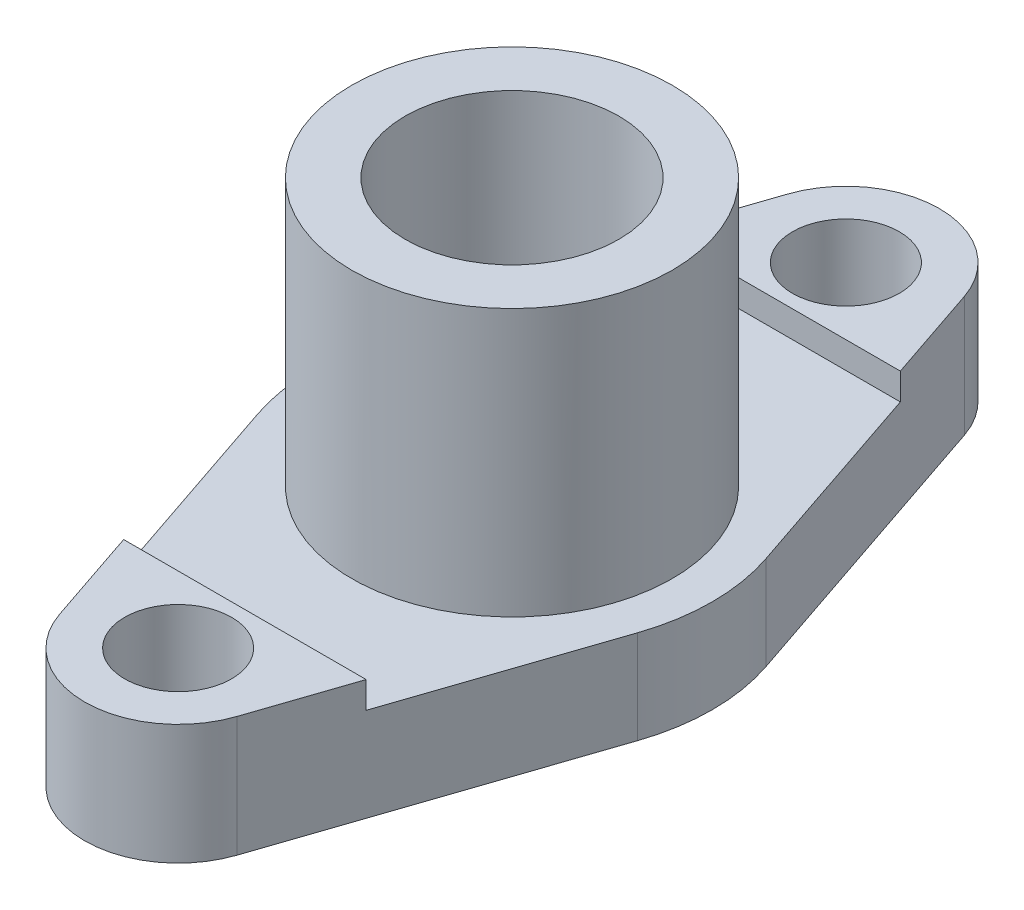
ISO-10303-21;
HEADER;
FILE_DESCRIPTION(('STEP AP214'),'2;1');
FILE_NAME('part.step','',(''),(''),'','','');
FILE_SCHEMA(('AUTOMOTIVE_DESIGN { 1 0 10303 214 1 1 1 1 }'));
ENDSEC;
DATA;
#1=APPLICATION_CONTEXT('core data for automotive mechanical design processes');
#2=APPLICATION_PROTOCOL_DEFINITION('international standard','automotive_design',2000,#1);
#3=PRODUCT_CONTEXT('',#1,'mechanical');
#4=PRODUCT('Part','Part','',(#3));
#5=PRODUCT_RELATED_PRODUCT_CATEGORY('part','',(#4));
#6=PRODUCT_DEFINITION_FORMATION('','',#4);
#7=PRODUCT_DEFINITION_CONTEXT('part definition',#1,'design');
#8=PRODUCT_DEFINITION('design','',#6,#7);
#9=PRODUCT_DEFINITION_SHAPE('','',#8);
#10=(LENGTH_UNIT() NAMED_UNIT(*) SI_UNIT(.MILLI.,.METRE.));
#11=(NAMED_UNIT(*) PLANE_ANGLE_UNIT() SI_UNIT($,.RADIAN.));
#12=(NAMED_UNIT(*) SI_UNIT($,.STERADIAN.) SOLID_ANGLE_UNIT());
#13=UNCERTAINTY_MEASURE_WITH_UNIT(LENGTH_MEASURE(1.E-05),#10,'distance_accuracy_value','');
#14=(GEOMETRIC_REPRESENTATION_CONTEXT(3) GLOBAL_UNCERTAINTY_ASSIGNED_CONTEXT((#13)) GLOBAL_UNIT_ASSIGNED_CONTEXT((#10,
#11,#12)) REPRESENTATION_CONTEXT('',''));
#15=CARTESIAN_POINT('',(0.,0.,0.));
#16=DIRECTION('',(0.,0.,1.));
#17=DIRECTION('',(1.,0.,0.));
#18=AXIS2_PLACEMENT_3D('',#15,#16,#17);
#19=CARTESIAN_POINT('',(0.,7.,0.));
#20=DIRECTION('',(0.,-1.,0.));
#21=DIRECTION('',(0.,0.,-1.));
#22=AXIS2_PLACEMENT_3D('',#19,#20,#21);
#23=PLANE('',#22);
#24=CARTESIAN_POINT('',(0.,7.,0.));
#25=DIRECTION('',(0.,-1.,0.));
#26=DIRECTION('',(0.,0.,-1.));
#27=AXIS2_PLACEMENT_3D('',#24,#25,#26);
#28=CIRCLE('',#27,12.);
#29=CARTESIAN_POINT('',(0.,7.,-12.));
#30=VERTEX_POINT('',#29);
#31=EDGE_CURVE('E11',#30,#30,#28,.T.);
#32=ORIENTED_EDGE('',*,*,#31,.T.);
#33=EDGE_LOOP('',(#32));
#34=FACE_BOUND('',#33,.T.);
#35=DIRECTION('',(-1.,0.,0.));
#36=VECTOR('',#35,1.);
#37=CARTESIAN_POINT('',(9.07731152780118,7.,20.));
#38=LINE('',#37,#36);
#39=CARTESIAN_POINT('',(9.07731152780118,7.,20.));
#40=VERTEX_POINT('',#39);
#41=CARTESIAN_POINT('',(-9.07731152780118,7.,20.));
#42=VERTEX_POINT('',#41);
#43=EDGE_CURVE('E150',#40,#42,#38,.T.);
#44=ORIENTED_EDGE('',*,*,#43,.F.);
#45=DIRECTION('',(-0.320000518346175,0.,0.947417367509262));
#46=VECTOR('',#45,1.);
#47=CARTESIAN_POINT('',(14.2112727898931,7.,4.80001192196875));
#48=LINE('',#47,#46);
#49=CARTESIAN_POINT('',(14.2112727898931,7.,4.80001192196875));
#50=VERTEX_POINT('',#49);
#51=EDGE_CURVE('E211',#50,#40,#48,.T.);
#52=ORIENTED_EDGE('',*,*,#51,.F.);
#53=CARTESIAN_POINT('',(0.,7.,0.));
#54=DIRECTION('',(0.,-1.,0.));
#55=DIRECTION('',(0.,0.,-1.));
#56=AXIS2_PLACEMENT_3D('',#53,#54,#55);
#57=CIRCLE('',#56,15.0000129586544);
#58=CARTESIAN_POINT('',(14.2112727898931,7.,-4.80001192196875));
#59=VERTEX_POINT('',#58);
#60=EDGE_CURVE('E208',#59,#50,#57,.T.);
#61=ORIENTED_EDGE('',*,*,#60,.F.);
#62=DIRECTION('',(0.320000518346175,0.,0.947417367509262));
#63=VECTOR('',#62,1.);
#64=CARTESIAN_POINT('',(14.2112727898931,7.,-4.80001192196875));
#65=LINE('',#64,#63);
#66=CARTESIAN_POINT('',(9.07731152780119,7.,-20.));
#67=VERTEX_POINT('',#66);
#68=EDGE_CURVE('E47',#67,#59,#65,.T.);
#69=ORIENTED_EDGE('',*,*,#68,.F.);
#70=DIRECTION('',(1.,0.,0.));
#71=VECTOR('',#70,1.);
#72=CARTESIAN_POINT('',(9.07731152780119,7.,-20.));
#73=LINE('',#72,#71);
#74=CARTESIAN_POINT('',(-9.07731152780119,7.,-20.));
#75=VERTEX_POINT('',#74);
#76=EDGE_CURVE('E165',#75,#67,#73,.T.);
#77=ORIENTED_EDGE('',*,*,#76,.F.);
#78=DIRECTION('',(0.320000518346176,0.,-0.947417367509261));
#79=VECTOR('',#78,1.);
#80=CARTESIAN_POINT('',(-14.2112727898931,7.,-4.80001192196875));
#81=LINE('',#80,#79);
#82=CARTESIAN_POINT('',(-14.2112727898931,7.,-4.80001192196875));
#83=VERTEX_POINT('',#82);
#84=EDGE_CURVE('E218',#83,#75,#81,.T.);
#85=ORIENTED_EDGE('',*,*,#84,.F.);
#86=CARTESIAN_POINT('',(0.,7.,0.));
#87=DIRECTION('',(0.,-1.,0.));
#88=DIRECTION('',(0.,0.,-1.));
#89=AXIS2_PLACEMENT_3D('',#86,#87,#88);
#90=CIRCLE('',#89,15.0000129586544);
#91=CARTESIAN_POINT('',(-14.2112727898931,7.,4.80001192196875));
#92=VERTEX_POINT('',#91);
#93=EDGE_CURVE('E215',#92,#83,#90,.T.);
#94=ORIENTED_EDGE('',*,*,#93,.F.);
#95=DIRECTION('',(-0.320000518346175,0.,-0.947417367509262));
#96=VECTOR('',#95,1.);
#97=CARTESIAN_POINT('',(-6.63192157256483,7.,27.2400036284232));
#98=LINE('',#97,#96);
#99=EDGE_CURVE('E213',#42,#92,#98,.T.);
#100=ORIENTED_EDGE('',*,*,#99,.F.);
#101=EDGE_LOOP('',(#44,#52,#61,#69,#77,#85,#94,#100));
#102=FACE_BOUND('',#101,.T.);
#103=ADVANCED_FACE('F31',(#34,#102),#23,.F.);
#104=CARTESIAN_POINT('',(0.,27.,0.));
#105=DIRECTION('',(0.,-1.,0.));
#106=DIRECTION('',(0.,0.,-1.));
#107=AXIS2_PLACEMENT_3D('',#104,#105,#106);
#108=CYLINDRICAL_SURFACE('',#107,12.);
#109=CARTESIAN_POINT('',(0.,27.,0.));
#110=DIRECTION('',(0.,1.,0.));
#111=DIRECTION('',(0.,0.,1.));
#112=AXIS2_PLACEMENT_3D('',#109,#110,#111);
#113=CIRCLE('',#112,12.);
#114=CARTESIAN_POINT('',(0.,27.,12.));
#115=VERTEX_POINT('',#114);
#116=EDGE_CURVE('E35',#115,#115,#113,.T.);
#117=ORIENTED_EDGE('',*,*,#116,.F.);
#118=EDGE_LOOP('',(#117));
#119=FACE_BOUND('',#118,.T.);
#120=ORIENTED_EDGE('',*,*,#31,.F.);
#121=EDGE_LOOP('',(#120));
#122=FACE_BOUND('',#121,.T.);
#123=ADVANCED_FACE('F33',(#119,#122),#108,.T.);
#124=CARTESIAN_POINT('',(0.,27.,0.));
#125=DIRECTION('',(0.,1.,0.));
#126=DIRECTION('',(0.,0.,1.));
#127=AXIS2_PLACEMENT_3D('',#124,#125,#126);
#128=PLANE('',#127);
#129=ORIENTED_EDGE('',*,*,#116,.T.);
#130=EDGE_LOOP('',(#129));
#131=FACE_BOUND('',#130,.T.);
#132=CARTESIAN_POINT('',(0.,27.,0.));
#133=DIRECTION('',(0.,1.,0.));
#134=DIRECTION('',(0.,0.,1.));
#135=AXIS2_PLACEMENT_3D('',#132,#133,#134);
#136=CIRCLE('',#135,8.);
#137=CARTESIAN_POINT('',(0.,27.,8.));
#138=VERTEX_POINT('',#137);
#139=EDGE_CURVE('E234',#138,#138,#136,.T.);
#140=ORIENTED_EDGE('',*,*,#139,.F.);
#141=EDGE_LOOP('',(#140));
#142=FACE_BOUND('',#141,.T.);
#143=ADVANCED_FACE('F241',(#131,#142),#128,.T.);
#144=CARTESIAN_POINT('',(0.,0.,0.));
#145=DIRECTION('',(0.,1.,0.));
#146=DIRECTION('',(0.,0.,1.));
#147=AXIS2_PLACEMENT_3D('',#144,#145,#146);
#148=PLANE('',#147);
#149=CARTESIAN_POINT('',(0.,0.,0.));
#150=DIRECTION('',(0.,1.,0.));
#151=DIRECTION('',(0.,0.,1.));
#152=AXIS2_PLACEMENT_3D('',#149,#150,#151);
#153=CIRCLE('',#152,8.);
#154=CARTESIAN_POINT('',(0.,0.,8.));
#155=VERTEX_POINT('',#154);
#156=EDGE_CURVE('E223',#155,#155,#153,.T.);
#157=ORIENTED_EDGE('',*,*,#156,.T.);
#158=EDGE_LOOP('',(#157));
#159=FACE_BOUND('',#158,.T.);
#160=CARTESIAN_POINT('',(0.,0.,0.));
#161=DIRECTION('',(0.,-1.,0.));
#162=DIRECTION('',(0.,0.,-1.));
#163=AXIS2_PLACEMENT_3D('',#160,#161,#162);
#164=CIRCLE('',#163,15.0000129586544);
#165=CARTESIAN_POINT('',(14.2112727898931,0.,-4.80001192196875));
#166=VERTEX_POINT('',#165);
#167=CARTESIAN_POINT('',(14.2112727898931,0.,4.80001192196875));
#168=VERTEX_POINT('',#167);
#169=EDGE_CURVE('E187',#166,#168,#164,.T.);
#170=ORIENTED_EDGE('',*,*,#169,.T.);
#171=DIRECTION('',(-0.320000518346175,0.,0.947417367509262));
#172=VECTOR('',#171,1.);
#173=CARTESIAN_POINT('',(14.2112727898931,0.,4.80001192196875));
#174=LINE('',#173,#172);
#175=CARTESIAN_POINT('',(6.63192157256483,0.,27.2400036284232));
#176=VERTEX_POINT('',#175);
#177=EDGE_CURVE('E190',#168,#176,#174,.T.);
#178=ORIENTED_EDGE('',*,*,#177,.T.);
#179=CARTESIAN_POINT('',(0.,0.,25.));
#180=DIRECTION('',(0.,-1.,0.));
#181=DIRECTION('',(0.,0.,-1.));
#182=AXIS2_PLACEMENT_3D('',#179,#180,#181);
#183=CIRCLE('',#182,7.);
#184=CARTESIAN_POINT('',(-6.63192157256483,0.,27.2400036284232));
#185=VERTEX_POINT('',#184);
#186=EDGE_CURVE('E129',#176,#185,#183,.T.);
#187=ORIENTED_EDGE('',*,*,#186,.T.);
#188=DIRECTION('',(-0.320000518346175,0.,-0.947417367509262));
#189=VECTOR('',#188,1.);
#190=CARTESIAN_POINT('',(-6.63192157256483,0.,27.2400036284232));
#191=LINE('',#190,#189);
#192=CARTESIAN_POINT('',(-14.2112727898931,0.,4.80001192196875));
#193=VERTEX_POINT('',#192);
#194=EDGE_CURVE('E193',#185,#193,#191,.T.);
#195=ORIENTED_EDGE('',*,*,#194,.T.);
#196=CARTESIAN_POINT('',(0.,0.,0.));
#197=DIRECTION('',(0.,-1.,0.));
#198=DIRECTION('',(0.,0.,-1.));
#199=AXIS2_PLACEMENT_3D('',#196,#197,#198);
#200=CIRCLE('',#199,15.0000129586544);
#201=CARTESIAN_POINT('',(-14.2112727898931,0.,-4.80001192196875));
#202=VERTEX_POINT('',#201);
#203=EDGE_CURVE('E196',#193,#202,#200,.T.);
#204=ORIENTED_EDGE('',*,*,#203,.T.);
#205=DIRECTION('',(0.320000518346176,0.,-0.947417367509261));
#206=VECTOR('',#205,1.);
#207=CARTESIAN_POINT('',(-14.2112727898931,0.,-4.80001192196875));
#208=LINE('',#207,#206);
#209=CARTESIAN_POINT('',(-6.63192157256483,0.,-27.2400036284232));
#210=VERTEX_POINT('',#209);
#211=EDGE_CURVE('E199',#202,#210,#208,.T.);
#212=ORIENTED_EDGE('',*,*,#211,.T.);
#213=CARTESIAN_POINT('',(0.,0.,-25.));
#214=DIRECTION('',(0.,-1.,0.));
#215=DIRECTION('',(0.,0.,-1.));
#216=AXIS2_PLACEMENT_3D('',#213,#214,#215);
#217=CIRCLE('',#216,7.);
#218=CARTESIAN_POINT('',(6.63192157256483,0.,-27.2400036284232));
#219=VERTEX_POINT('',#218);
#220=EDGE_CURVE('E202',#210,#219,#217,.T.);
#221=ORIENTED_EDGE('',*,*,#220,.T.);
#222=DIRECTION('',(0.320000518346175,0.,0.947417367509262));
#223=VECTOR('',#222,1.);
#224=CARTESIAN_POINT('',(14.2112727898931,0.,-4.80001192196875));
#225=LINE('',#224,#223);
#226=EDGE_CURVE('E205',#219,#166,#225,.T.);
#227=ORIENTED_EDGE('',*,*,#226,.T.);
#228=EDGE_LOOP('',(#170,#178,#187,#195,#204,#212,#221,#227));
#229=FACE_BOUND('',#228,.T.);
#230=CARTESIAN_POINT('',(0.,0.,-25.));
#231=DIRECTION('',(0.,-1.,0.));
#232=DIRECTION('',(0.,0.,-1.));
#233=AXIS2_PLACEMENT_3D('',#230,#231,#232);
#234=CIRCLE('',#233,4.);
#235=CARTESIAN_POINT('',(0.,0.,-29.));
#236=VERTEX_POINT('',#235);
#237=EDGE_CURVE('E184',#236,#236,#234,.T.);
#238=ORIENTED_EDGE('',*,*,#237,.F.);
#239=EDGE_LOOP('',(#238));
#240=FACE_BOUND('',#239,.T.);
#241=CARTESIAN_POINT('',(0.,0.,25.));
#242=DIRECTION('',(0.,-1.,0.));
#243=DIRECTION('',(0.,0.,-1.));
#244=AXIS2_PLACEMENT_3D('',#241,#242,#243);
#245=CIRCLE('',#244,4.);
#246=CARTESIAN_POINT('',(0.,0.,21.));
#247=VERTEX_POINT('',#246);
#248=EDGE_CURVE('E181',#247,#247,#245,.T.);
#249=ORIENTED_EDGE('',*,*,#248,.F.);
#250=EDGE_LOOP('',(#249));
#251=FACE_BOUND('',#250,.T.);
#252=ADVANCED_FACE('F279',(#159,#229,#240,#251),#148,.F.);
#253=CARTESIAN_POINT('',(0.,27.,0.));
#254=DIRECTION('',(0.,-1.,0.));
#255=DIRECTION('',(0.,0.,-1.));
#256=AXIS2_PLACEMENT_3D('',#253,#254,#255);
#257=CYLINDRICAL_SURFACE('',#256,8.);
#258=ORIENTED_EDGE('',*,*,#156,.F.);
#259=EDGE_LOOP('',(#258));
#260=FACE_BOUND('',#259,.T.);
#261=ORIENTED_EDGE('',*,*,#139,.T.);
#262=EDGE_LOOP('',(#261));
#263=FACE_BOUND('',#262,.T.);
#264=ADVANCED_FACE('F324',(#260,#263),#257,.F.);
#265=CARTESIAN_POINT('',(0.,7.,0.));
#266=DIRECTION('',(0.,-1.,0.));
#267=DIRECTION('',(0.,0.,-1.));
#268=AXIS2_PLACEMENT_3D('',#265,#266,#267);
#269=CYLINDRICAL_SURFACE('',#268,15.0000129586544);
#270=ORIENTED_EDGE('',*,*,#169,.F.);
#271=DIRECTION('',(0.,-1.,0.));
#272=VECTOR('',#271,1.);
#273=CARTESIAN_POINT('',(14.2112727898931,7.,-4.80001192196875));
#274=LINE('',#273,#272);
#275=EDGE_CURVE('E221',#59,#166,#274,.T.);
#276=ORIENTED_EDGE('',*,*,#275,.F.);
#277=ORIENTED_EDGE('',*,*,#60,.T.);
#278=DIRECTION('',(0.,-1.,0.));
#279=VECTOR('',#278,1.);
#280=CARTESIAN_POINT('',(14.2112727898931,7.,4.80001192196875));
#281=LINE('',#280,#279);
#282=EDGE_CURVE('E134',#50,#168,#281,.T.);
#283=ORIENTED_EDGE('',*,*,#282,.T.);
#284=EDGE_LOOP('',(#270,#276,#277,#283));
#285=FACE_BOUND('',#284,.T.);
#286=ADVANCED_FACE('F260',(#285),#269,.T.);
#287=CARTESIAN_POINT('',(14.2112727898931,7.,-4.80001192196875));
#288=DIRECTION('',(0.947417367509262,0.,-0.320000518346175));
#289=DIRECTION('',(-0.320000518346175,0.,-0.947417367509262));
#290=AXIS2_PLACEMENT_3D('',#287,#288,#289);
#291=PLANE('',#290);
#292=ORIENTED_EDGE('',*,*,#226,.F.);
#293=DIRECTION('',(0.,-1.,0.));
#294=VECTOR('',#293,1.);
#295=CARTESIAN_POINT('',(6.63192157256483,7.,-27.2400036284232));
#296=LINE('',#295,#294);
#297=CARTESIAN_POINT('',(6.63192157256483,9.,-27.2400036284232));
#298=VERTEX_POINT('',#297);
#299=EDGE_CURVE('E224',#298,#219,#296,.T.);
#300=ORIENTED_EDGE('',*,*,#299,.F.);
#301=DIRECTION('',(-0.320000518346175,0.,-0.947417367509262));
#302=VECTOR('',#301,1.);
#303=CARTESIAN_POINT('',(9.07731152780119,9.,-20.));
#304=LINE('',#303,#302);
#305=CARTESIAN_POINT('',(9.07731152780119,9.,-20.));
#306=VERTEX_POINT('',#305);
#307=EDGE_CURVE('E166',#306,#298,#304,.T.);
#308=ORIENTED_EDGE('',*,*,#307,.F.);
#309=DIRECTION('',(0.,-1.,0.));
#310=VECTOR('',#309,1.);
#311=CARTESIAN_POINT('',(9.07731152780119,9.,-20.));
#312=LINE('',#311,#310);
#313=EDGE_CURVE('E176',#306,#67,#312,.T.);
#314=ORIENTED_EDGE('',*,*,#313,.T.);
#315=ORIENTED_EDGE('',*,*,#68,.T.);
#316=ORIENTED_EDGE('',*,*,#275,.T.);
#317=EDGE_LOOP('',(#292,#300,#308,#314,#315,#316));
#318=FACE_BOUND('',#317,.T.);
#319=ADVANCED_FACE('F307',(#318),#291,.T.);
#320=CARTESIAN_POINT('',(0.,7.,-25.));
#321=DIRECTION('',(0.,-1.,0.));
#322=DIRECTION('',(0.,0.,-1.));
#323=AXIS2_PLACEMENT_3D('',#320,#321,#322);
#324=CYLINDRICAL_SURFACE('',#323,7.);
#325=ORIENTED_EDGE('',*,*,#220,.F.);
#326=DIRECTION('',(0.,-1.,0.));
#327=VECTOR('',#326,1.);
#328=CARTESIAN_POINT('',(-6.63192157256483,7.,-27.2400036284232));
#329=LINE('',#328,#327);
#330=CARTESIAN_POINT('',(-6.63192157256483,9.,-27.2400036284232));
#331=VERTEX_POINT('',#330);
#332=EDGE_CURVE('E226',#331,#210,#329,.T.);
#333=ORIENTED_EDGE('',*,*,#332,.F.);
#334=CARTESIAN_POINT('',(0.,9.,-25.));
#335=DIRECTION('',(0.,1.,0.));
#336=DIRECTION('',(0.,0.,1.));
#337=AXIS2_PLACEMENT_3D('',#334,#335,#336);
#338=CIRCLE('',#337,7.);
#339=EDGE_CURVE('E169',#298,#331,#338,.T.);
#340=ORIENTED_EDGE('',*,*,#339,.F.);
#341=ORIENTED_EDGE('',*,*,#299,.T.);
#342=EDGE_LOOP('',(#325,#333,#340,#341));
#343=FACE_BOUND('',#342,.T.);
#344=ADVANCED_FACE('F276',(#343),#324,.T.);
#345=CARTESIAN_POINT('',(-14.2112727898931,7.,-4.80001192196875));
#346=DIRECTION('',(-0.947417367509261,0.,-0.320000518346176));
#347=DIRECTION('',(-0.320000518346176,0.,0.947417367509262));
#348=AXIS2_PLACEMENT_3D('',#345,#346,#347);
#349=PLANE('',#348);
#350=ORIENTED_EDGE('',*,*,#211,.F.);
#351=DIRECTION('',(0.,-1.,0.));
#352=VECTOR('',#351,1.);
#353=CARTESIAN_POINT('',(-14.2112727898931,7.,-4.80001192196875));
#354=LINE('',#353,#352);
#355=EDGE_CURVE('E55',#83,#202,#354,.T.);
#356=ORIENTED_EDGE('',*,*,#355,.F.);
#357=ORIENTED_EDGE('',*,*,#84,.T.);
#358=DIRECTION('',(0.,-1.,0.));
#359=VECTOR('',#358,1.);
#360=CARTESIAN_POINT('',(-9.07731152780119,9.,-20.));
#361=LINE('',#360,#359);
#362=CARTESIAN_POINT('',(-9.07731152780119,9.,-20.));
#363=VERTEX_POINT('',#362);
#364=EDGE_CURVE('E179',#363,#75,#361,.T.);
#365=ORIENTED_EDGE('',*,*,#364,.F.);
#366=DIRECTION('',(-0.320000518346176,0.,0.947417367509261));
#367=VECTOR('',#366,1.);
#368=CARTESIAN_POINT('',(-9.07731152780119,9.,-20.));
#369=LINE('',#368,#367);
#370=EDGE_CURVE('E172',#331,#363,#369,.T.);
#371=ORIENTED_EDGE('',*,*,#370,.F.);
#372=ORIENTED_EDGE('',*,*,#332,.T.);
#373=EDGE_LOOP('',(#350,#356,#357,#365,#371,#372));
#374=FACE_BOUND('',#373,.T.);
#375=ADVANCED_FACE('F265',(#374),#349,.T.);
#376=CARTESIAN_POINT('',(0.,7.,0.));
#377=DIRECTION('',(0.,-1.,0.));
#378=DIRECTION('',(0.,0.,-1.));
#379=AXIS2_PLACEMENT_3D('',#376,#377,#378);
#380=CYLINDRICAL_SURFACE('',#379,15.0000129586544);
#381=ORIENTED_EDGE('',*,*,#203,.F.);
#382=DIRECTION('',(0.,-1.,0.));
#383=VECTOR('',#382,1.);
#384=CARTESIAN_POINT('',(-14.2112727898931,7.,4.80001192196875));
#385=LINE('',#384,#383);
#386=EDGE_CURVE('E229',#92,#193,#385,.T.);
#387=ORIENTED_EDGE('',*,*,#386,.F.);
#388=ORIENTED_EDGE('',*,*,#93,.T.);
#389=ORIENTED_EDGE('',*,*,#355,.T.);
#390=EDGE_LOOP('',(#381,#387,#388,#389));
#391=FACE_BOUND('',#390,.T.);
#392=ADVANCED_FACE('F284',(#391),#380,.T.);
#393=CARTESIAN_POINT('',(-6.63192157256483,7.,27.2400036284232));
#394=DIRECTION('',(-0.947417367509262,0.,0.320000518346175));
#395=DIRECTION('',(0.320000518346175,0.,0.947417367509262));
#396=AXIS2_PLACEMENT_3D('',#393,#394,#395);
#397=PLANE('',#396);
#398=ORIENTED_EDGE('',*,*,#194,.F.);
#399=DIRECTION('',(0.,-1.,0.));
#400=VECTOR('',#399,1.);
#401=CARTESIAN_POINT('',(-6.63192157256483,7.,27.2400036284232));
#402=LINE('',#401,#400);
#403=CARTESIAN_POINT('',(-6.63192157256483,9.,27.2400036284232));
#404=VERTEX_POINT('',#403);
#405=EDGE_CURVE('E133',#404,#185,#402,.T.);
#406=ORIENTED_EDGE('',*,*,#405,.F.);
#407=DIRECTION('',(0.320000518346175,0.,0.947417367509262));
#408=VECTOR('',#407,1.);
#409=CARTESIAN_POINT('',(-9.07731152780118,9.,20.));
#410=LINE('',#409,#408);
#411=CARTESIAN_POINT('',(-9.07731152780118,9.,20.));
#412=VERTEX_POINT('',#411);
#413=EDGE_CURVE('E149',#412,#404,#410,.T.);
#414=ORIENTED_EDGE('',*,*,#413,.F.);
#415=DIRECTION('',(0.,-1.,0.));
#416=VECTOR('',#415,1.);
#417=CARTESIAN_POINT('',(-9.07731152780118,9.,20.));
#418=LINE('',#417,#416);
#419=EDGE_CURVE('E157',#412,#42,#418,.T.);
#420=ORIENTED_EDGE('',*,*,#419,.T.);
#421=ORIENTED_EDGE('',*,*,#99,.T.);
#422=ORIENTED_EDGE('',*,*,#386,.T.);
#423=EDGE_LOOP('',(#398,#406,#414,#420,#421,#422));
#424=FACE_BOUND('',#423,.T.);
#425=ADVANCED_FACE('F286',(#424),#397,.T.);
#426=CARTESIAN_POINT('',(0.,7.,25.));
#427=DIRECTION('',(0.,-1.,0.));
#428=DIRECTION('',(0.,0.,-1.));
#429=AXIS2_PLACEMENT_3D('',#426,#427,#428);
#430=CYLINDRICAL_SURFACE('',#429,7.);
#431=ORIENTED_EDGE('',*,*,#186,.F.);
#432=DIRECTION('',(0.,-1.,0.));
#433=VECTOR('',#432,1.);
#434=CARTESIAN_POINT('',(6.63192157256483,7.,27.2400036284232));
#435=LINE('',#434,#433);
#436=CARTESIAN_POINT('',(6.63192157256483,9.,27.2400036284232));
#437=VERTEX_POINT('',#436);
#438=EDGE_CURVE('E123',#437,#176,#435,.T.);
#439=ORIENTED_EDGE('',*,*,#438,.F.);
#440=CARTESIAN_POINT('',(0.,9.,25.));
#441=DIRECTION('',(0.,1.,0.));
#442=DIRECTION('',(0.,0.,-1.));
#443=AXIS2_PLACEMENT_3D('',#440,#441,#442);
#444=CIRCLE('',#443,7.);
#445=EDGE_CURVE('E127',#404,#437,#444,.T.);
#446=ORIENTED_EDGE('',*,*,#445,.F.);
#447=ORIENTED_EDGE('',*,*,#405,.T.);
#448=EDGE_LOOP('',(#431,#439,#446,#447));
#449=FACE_BOUND('',#448,.T.);
#450=ADVANCED_FACE('F125',(#449),#430,.T.);
#451=CARTESIAN_POINT('',(14.2112727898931,7.,4.80001192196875));
#452=DIRECTION('',(0.947417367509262,0.,0.320000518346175));
#453=DIRECTION('',(0.320000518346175,0.,-0.947417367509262));
#454=AXIS2_PLACEMENT_3D('',#451,#452,#453);
#455=PLANE('',#454);
#456=ORIENTED_EDGE('',*,*,#177,.F.);
#457=ORIENTED_EDGE('',*,*,#282,.F.);
#458=ORIENTED_EDGE('',*,*,#51,.T.);
#459=DIRECTION('',(0.,-1.,0.));
#460=VECTOR('',#459,1.);
#461=CARTESIAN_POINT('',(9.07731152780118,9.,20.));
#462=LINE('',#461,#460);
#463=CARTESIAN_POINT('',(9.07731152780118,9.,20.));
#464=VERTEX_POINT('',#463);
#465=EDGE_CURVE('E140',#464,#40,#462,.T.);
#466=ORIENTED_EDGE('',*,*,#465,.F.);
#467=DIRECTION('',(0.320000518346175,0.,-0.947417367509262));
#468=VECTOR('',#467,1.);
#469=CARTESIAN_POINT('',(9.07731152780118,9.,20.));
#470=LINE('',#469,#468);
#471=EDGE_CURVE('E137',#437,#464,#470,.T.);
#472=ORIENTED_EDGE('',*,*,#471,.F.);
#473=ORIENTED_EDGE('',*,*,#438,.T.);
#474=EDGE_LOOP('',(#456,#457,#458,#466,#472,#473));
#475=FACE_BOUND('',#474,.T.);
#476=ADVANCED_FACE('F138',(#475),#455,.T.);
#477=CARTESIAN_POINT('',(0.,7.,-25.));
#478=DIRECTION('',(0.,-1.,0.));
#479=DIRECTION('',(0.,0.,-1.));
#480=AXIS2_PLACEMENT_3D('',#477,#478,#479);
#481=CYLINDRICAL_SURFACE('',#480,4.);
#482=ORIENTED_EDGE('',*,*,#237,.T.);
#483=EDGE_LOOP('',(#482));
#484=FACE_BOUND('',#483,.T.);
#485=CARTESIAN_POINT('',(0.,9.,-25.));
#486=DIRECTION('',(0.,1.,0.));
#487=DIRECTION('',(0.,0.,1.));
#488=AXIS2_PLACEMENT_3D('',#485,#486,#487);
#489=CIRCLE('',#488,4.);
#490=CARTESIAN_POINT('',(0.,9.,-21.));
#491=VERTEX_POINT('',#490);
#492=EDGE_CURVE('E162',#491,#491,#489,.T.);
#493=ORIENTED_EDGE('',*,*,#492,.T.);
#494=EDGE_LOOP('',(#493));
#495=FACE_BOUND('',#494,.T.);
#496=ADVANCED_FACE('F302',(#484,#495),#481,.F.);
#497=CARTESIAN_POINT('',(0.,7.,25.));
#498=DIRECTION('',(0.,-1.,0.));
#499=DIRECTION('',(0.,0.,-1.));
#500=AXIS2_PLACEMENT_3D('',#497,#498,#499);
#501=CYLINDRICAL_SURFACE('',#500,4.);
#502=ORIENTED_EDGE('',*,*,#248,.T.);
#503=EDGE_LOOP('',(#502));
#504=FACE_BOUND('',#503,.T.);
#505=CARTESIAN_POINT('',(0.,9.,25.));
#506=DIRECTION('',(0.,1.,0.));
#507=DIRECTION('',(0.,0.,-1.));
#508=AXIS2_PLACEMENT_3D('',#505,#506,#507);
#509=CIRCLE('',#508,4.);
#510=CARTESIAN_POINT('',(0.,9.,21.));
#511=VERTEX_POINT('',#510);
#512=EDGE_CURVE('E152',#511,#511,#509,.T.);
#513=ORIENTED_EDGE('',*,*,#512,.T.);
#514=EDGE_LOOP('',(#513));
#515=FACE_BOUND('',#514,.T.);
#516=ADVANCED_FACE('F297',(#504,#515),#501,.F.);
#517=CARTESIAN_POINT('',(0.,9.,-25.));
#518=DIRECTION('',(0.,1.,0.));
#519=DIRECTION('',(0.,0.,1.));
#520=AXIS2_PLACEMENT_3D('',#517,#518,#519);
#521=PLANE('',#520);
#522=ORIENTED_EDGE('',*,*,#307,.T.);
#523=ORIENTED_EDGE('',*,*,#339,.T.);
#524=ORIENTED_EDGE('',*,*,#370,.T.);
#525=DIRECTION('',(1.,0.,0.));
#526=VECTOR('',#525,1.);
#527=CARTESIAN_POINT('',(9.07731152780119,9.,-20.));
#528=LINE('',#527,#526);
#529=EDGE_CURVE('E174',#363,#306,#528,.T.);
#530=ORIENTED_EDGE('',*,*,#529,.T.);
#531=EDGE_LOOP('',(#522,#523,#524,#530));
#532=FACE_BOUND('',#531,.T.);
#533=ORIENTED_EDGE('',*,*,#492,.F.);
#534=EDGE_LOOP('',(#533));
#535=FACE_BOUND('',#534,.T.);
#536=ADVANCED_FACE('F271',(#532,#535),#521,.T.);
#537=CARTESIAN_POINT('',(9.07731152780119,9.,-20.));
#538=DIRECTION('',(0.,0.,-1.));
#539=DIRECTION('',(-1.,0.,0.));
#540=AXIS2_PLACEMENT_3D('',#537,#538,#539);
#541=PLANE('',#540);
#542=ORIENTED_EDGE('',*,*,#76,.T.);
#543=ORIENTED_EDGE('',*,*,#313,.F.);
#544=ORIENTED_EDGE('',*,*,#529,.F.);
#545=ORIENTED_EDGE('',*,*,#364,.T.);
#546=EDGE_LOOP('',(#542,#543,#544,#545));
#547=FACE_BOUND('',#546,.T.);
#548=ADVANCED_FACE('F268',(#547),#541,.F.);
#549=CARTESIAN_POINT('',(0.,9.,25.));
#550=DIRECTION('',(0.,-1.,0.));
#551=DIRECTION('',(0.,0.,-1.));
#552=AXIS2_PLACEMENT_3D('',#549,#550,#551);
#553=PLANE('',#552);
#554=ORIENTED_EDGE('',*,*,#445,.T.);
#555=ORIENTED_EDGE('',*,*,#471,.T.);
#556=DIRECTION('',(-1.,0.,0.));
#557=VECTOR('',#556,1.);
#558=CARTESIAN_POINT('',(9.07731152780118,9.,20.));
#559=LINE('',#558,#557);
#560=EDGE_CURVE('E143',#464,#412,#559,.T.);
#561=ORIENTED_EDGE('',*,*,#560,.T.);
#562=ORIENTED_EDGE('',*,*,#413,.T.);
#563=EDGE_LOOP('',(#554,#555,#561,#562));
#564=FACE_BOUND('',#563,.T.);
#565=ORIENTED_EDGE('',*,*,#512,.F.);
#566=EDGE_LOOP('',(#565));
#567=FACE_BOUND('',#566,.T.);
#568=ADVANCED_FACE('F146',(#564,#567),#553,.F.);
#569=CARTESIAN_POINT('',(9.07731152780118,9.,20.));
#570=DIRECTION('',(0.,0.,1.));
#571=DIRECTION('',(1.,0.,0.));
#572=AXIS2_PLACEMENT_3D('',#569,#570,#571);
#573=PLANE('',#572);
#574=ORIENTED_EDGE('',*,*,#43,.T.);
#575=ORIENTED_EDGE('',*,*,#419,.F.);
#576=ORIENTED_EDGE('',*,*,#560,.F.);
#577=ORIENTED_EDGE('',*,*,#465,.T.);
#578=EDGE_LOOP('',(#574,#575,#576,#577));
#579=FACE_BOUND('',#578,.T.);
#580=ADVANCED_FACE('F287',(#579),#573,.F.);
#581=CLOSED_SHELL('',(#103,#123,#143,#252,#264,#286,#319,#344,#375,#392,#425,#450,#476,#496,
#516,#536,#548,#568,#580));
#582=MANIFOLD_SOLID_BREP('B2',#581);
#583=ADVANCED_BREP_SHAPE_REPRESENTATION('',(#18,#582),#14);
#584=SHAPE_DEFINITION_REPRESENTATION(#9,#583);
ENDSEC;
END-ISO-10303-21;
